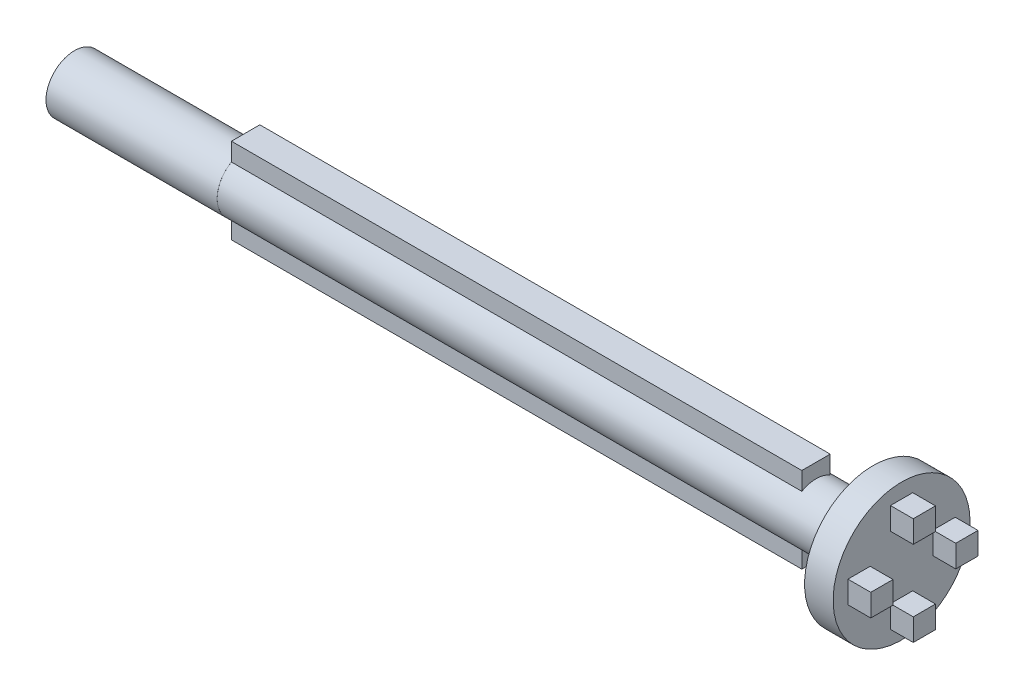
from build123d import *

# Parameters (mm, degrees)
BOSS_EXTRUDE1_DEPTH = 110
SKETCH3_R           = 12
BOSS_EXTRUDE2_DEPTH = 5
SKETCH4_W           = 3.9
SKETCH4_H           = 3.9
BOSS_EXTRUDE3_DEPTH = 4
SKETCH5_R           = 5
BOSS_EXTRUDE4_DEPTH = 30
CUT_EXTRUDE1_DEPTH  = 10


with BuildPart() as part:
    # Sketch2 → Boss-Extrude1 (new body)
    with BuildSketch(Plane(origin=(0, 0, 0), x_dir=(0, 0, -1), z_dir=(1, 0, 0))):
        with BuildLine():
            Line((-2.49, -4.324349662), (-2.49, 4.324349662))
            ThreePointArc((-2.49, 4.324349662), (-4.99, 0), (-2.49, -4.324349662))
        make_face()
        with BuildLine():
            ThreePointArc((2.49, 4.324349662), (0, 4.99), (-2.49, 4.324349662))
            Line((-2.49, 4.324349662), (-2.49, -4.324349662))
            ThreePointArc((-2.49, -4.324349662), (0, -4.99), (2.49, -4.324349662))
            Line((2.49, -4.324349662), (2.49, 4.324349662))
        make_face()
        with BuildLine():
            ThreePointArc((4.99, 0), (4.320023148, 2.497498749), (2.49, 4.324349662))
            Line((2.49, 4.324349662), (2.49, -4.324349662))
            ThreePointArc((2.49, -4.324349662), (4.320023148, -2.497498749), (4.99, 0))
        make_face()
        with BuildLine():
            Line((2.49, 7.49), (-2.49, 7.49))
            Line((-2.49, 7.49), (-2.49, 4.324349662))
            ThreePointArc((-2.49, 4.324349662), (0, 4.99), (2.49, 4.324349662))
            Line((2.49, 4.324349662), (2.49, 7.49))
        make_face()
        with BuildLine():
            ThreePointArc((2.49, -4.324349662), (0, -4.99), (-2.49, -4.324349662))
            Line((-2.49, -4.324349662), (-2.49, -7.49))
            Line((-2.49, -7.49), (2.49, -7.49))
            Line((2.49, -7.49), (2.49, -4.324349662))
        make_face()
    extrude(amount=BOSS_EXTRUDE1_DEPTH)

    # Sketch3 → Boss-Extrude2 (add)
    with BuildSketch(Plane(origin=(110, 0, 0), x_dir=(0, 0, -1), z_dir=(1, 0, 0))):
        Circle(SKETCH3_R)
    extrude(amount=BOSS_EXTRUDE2_DEPTH)

    # Sketch4 → Boss-Extrude3 (add)
    with BuildSketch(Plane(origin=(115, 0, 0), x_dir=(0, 0, -1), z_dir=(1, 0, 0))):
        with Locations((0, 7.45)):
            Rectangle(SKETCH4_W, SKETCH4_H)
        with Locations((-7.45, 0)):
            Rectangle(SKETCH4_W, SKETCH4_H)
        with Locations((0, -7.45)):
            Rectangle(SKETCH4_W, SKETCH4_H)
        with Locations((7.45, 0)):
            Rectangle(SKETCH4_W, SKETCH4_H)
    extrude(amount=BOSS_EXTRUDE3_DEPTH)

    # Sketch5 → Boss-Extrude4 (add)
    with BuildSketch(Plane.ZY):
        with Locations(Location((0, 0, 0), (0, 0, 119.867769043))):
            Circle(SKETCH5_R)
    extrude(amount=BOSS_EXTRUDE4_DEPTH)

    # Sketch7 → Cut-Extrude1 (cut)
    with BuildSketch(Plane.ZY.offset(-100)):
        with BuildLine():
            Line((2.49, 7.49), (-2.49, 7.49))
            Line((-2.49, 7.49), (-2.49, 4.324349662))
            ThreePointArc((-2.49, 4.324349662), (0, 4.99), (2.49, 4.324349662))
            Line((2.49, 4.324349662), (2.49, 7.49))
        make_face()
        with BuildLine():
            ThreePointArc((2.49, -4.324349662), (0, -4.99), (-2.49, -4.324349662))
            Line((-2.49, -4.324349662), (-2.49, -7.49))
            Line((-2.49, -7.49), (2.49, -7.49))
            Line((2.49, -7.49), (2.49, -4.324349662))
        make_face()
    extrude(amount=-CUT_EXTRUDE1_DEPTH, mode=Mode.SUBTRACT)


solid = part.part
